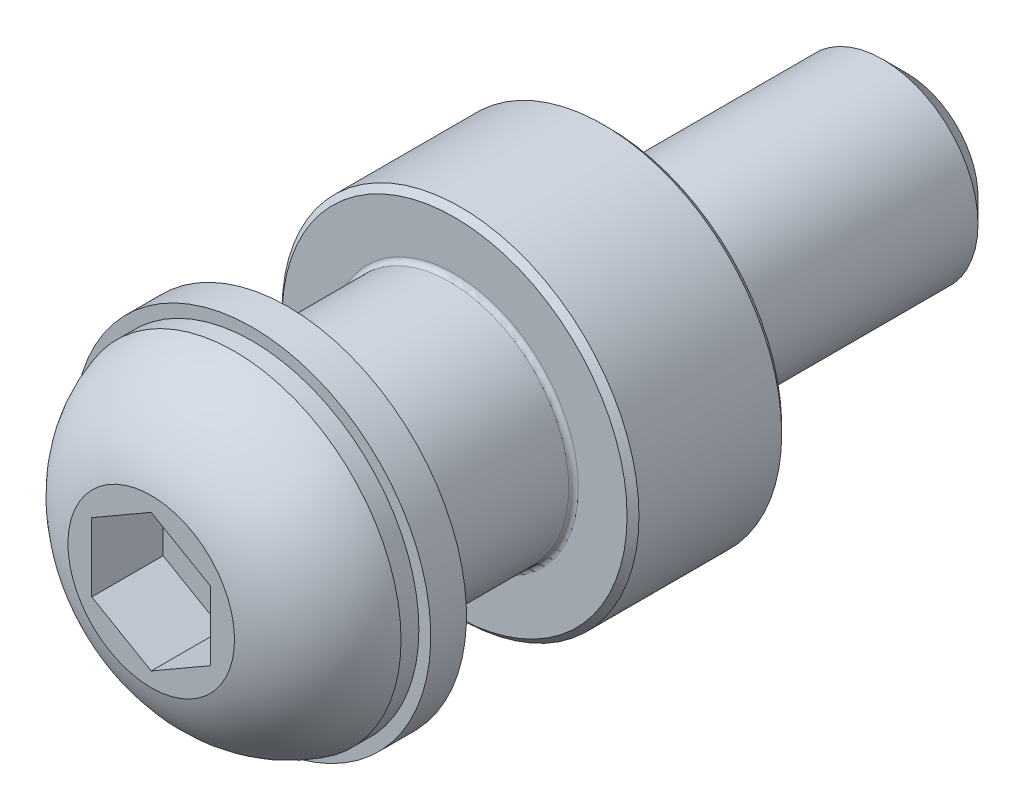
ISO-10303-21;
HEADER;
FILE_DESCRIPTION(('STEP AP214'),'2;1');
FILE_NAME('part.step','',(''),(''),'','','');
FILE_SCHEMA(('AUTOMOTIVE_DESIGN { 1 0 10303 214 1 1 1 1 }'));
ENDSEC;
DATA;
#1=APPLICATION_CONTEXT('core data for automotive mechanical design processes');
#2=APPLICATION_PROTOCOL_DEFINITION('international standard','automotive_design',2000,#1);
#3=PRODUCT_CONTEXT('',#1,'mechanical');
#4=PRODUCT('Part','Part','',(#3));
#5=PRODUCT_RELATED_PRODUCT_CATEGORY('part','',(#4));
#6=PRODUCT_DEFINITION_FORMATION('','',#4);
#7=PRODUCT_DEFINITION_CONTEXT('part definition',#1,'design');
#8=PRODUCT_DEFINITION('design','',#6,#7);
#9=PRODUCT_DEFINITION_SHAPE('','',#8);
#10=(LENGTH_UNIT() NAMED_UNIT(*) SI_UNIT(.MILLI.,.METRE.));
#11=(NAMED_UNIT(*) PLANE_ANGLE_UNIT() SI_UNIT($,.RADIAN.));
#12=(NAMED_UNIT(*) SI_UNIT($,.STERADIAN.) SOLID_ANGLE_UNIT());
#13=UNCERTAINTY_MEASURE_WITH_UNIT(LENGTH_MEASURE(1.E-05),#10,'distance_accuracy_value','');
#14=(GEOMETRIC_REPRESENTATION_CONTEXT(3) GLOBAL_UNCERTAINTY_ASSIGNED_CONTEXT((#13)) GLOBAL_UNIT_ASSIGNED_CONTEXT((#10,
#11,#12)) REPRESENTATION_CONTEXT('',''));
#15=CARTESIAN_POINT('',(0.,0.,0.));
#16=DIRECTION('',(0.,0.,1.));
#17=DIRECTION('',(1.,0.,0.));
#18=AXIS2_PLACEMENT_3D('',#15,#16,#17);
#19=CARTESIAN_POINT('',(-5.,-8.66025403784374,32.5));
#20=DIRECTION('',(0.,0.,1.));
#21=DIRECTION('',(0.,-1.,0.));
#22=AXIS2_PLACEMENT_3D('',#19,#20,#21);
#23=PLANE('',#22);
#24=DIRECTION('',(-0.86602540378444,-0.5,0.));
#25=VECTOR('',#24,1.);
#26=CARTESIAN_POINT('',(5.,-2.88675134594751,32.5));
#27=LINE('',#26,#25);
#28=CARTESIAN_POINT('',(5.,-2.88675134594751,32.5));
#29=VERTEX_POINT('',#28);
#30=CARTESIAN_POINT('',(0.,-5.77350269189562,32.5));
#31=VERTEX_POINT('',#30);
#32=EDGE_CURVE('E68',#29,#31,#27,.T.);
#33=ORIENTED_EDGE('',*,*,#32,.F.);
#34=DIRECTION('',(0.,-1.,0.));
#35=VECTOR('',#34,1.);
#36=CARTESIAN_POINT('',(5.,2.88675134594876,32.5));
#37=LINE('',#36,#35);
#38=CARTESIAN_POINT('',(5.,2.88675134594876,32.5));
#39=VERTEX_POINT('',#38);
#40=EDGE_CURVE('E116',#39,#29,#37,.T.);
#41=ORIENTED_EDGE('',*,*,#40,.F.);
#42=DIRECTION('',(-0.86602540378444,0.5,0.));
#43=VECTOR('',#42,1.);
#44=CARTESIAN_POINT('',(5.,2.88675134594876,32.5));
#45=LINE('',#44,#43);
#46=CARTESIAN_POINT('',(0.,5.77350269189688,32.5));
#47=VERTEX_POINT('',#46);
#48=EDGE_CURVE('E113',#39,#47,#45,.T.);
#49=ORIENTED_EDGE('',*,*,#48,.T.);
#50=DIRECTION('',(0.86602540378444,0.5,0.));
#51=VECTOR('',#50,1.);
#52=CARTESIAN_POINT('',(-5.,2.88675134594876,32.5));
#53=LINE('',#52,#51);
#54=CARTESIAN_POINT('',(-5.,2.88675134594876,32.5));
#55=VERTEX_POINT('',#54);
#56=EDGE_CURVE('E110',#55,#47,#53,.T.);
#57=ORIENTED_EDGE('',*,*,#56,.F.);
#58=DIRECTION('',(0.,-1.,0.));
#59=VECTOR('',#58,1.);
#60=CARTESIAN_POINT('',(-5.,2.88675134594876,32.5));
#61=LINE('',#60,#59);
#62=CARTESIAN_POINT('',(-5.,-2.88675134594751,32.5));
#63=VERTEX_POINT('',#62);
#64=EDGE_CURVE('E107',#55,#63,#61,.T.);
#65=ORIENTED_EDGE('',*,*,#64,.T.);
#66=DIRECTION('',(0.86602540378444,-0.5,0.));
#67=VECTOR('',#66,1.);
#68=CARTESIAN_POINT('',(-5.,-2.88675134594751,32.5));
#69=LINE('',#68,#67);
#70=EDGE_CURVE('E105',#63,#31,#69,.T.);
#71=ORIENTED_EDGE('',*,*,#70,.T.);
#72=EDGE_LOOP('',(#33,#41,#49,#57,#65,#71));
#73=FACE_BOUND('',#72,.T.);
#74=ADVANCED_FACE('F14',(#73),#23,.T.);
#75=CARTESIAN_POINT('',(5.,2.88675134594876,32.5));
#76=DIRECTION('',(0.5,0.86602540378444,0.));
#77=DIRECTION('',(-0.86602540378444,0.5,0.));
#78=AXIS2_PLACEMENT_3D('',#75,#76,#77);
#79=PLANE('',#78);
#80=DIRECTION('',(0.,0.,1.));
#81=VECTOR('',#80,1.);
#82=CARTESIAN_POINT('',(5.,2.88675134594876,32.5));
#83=LINE('',#82,#81);
#84=CARTESIAN_POINT('',(5.,2.88675134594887,38.5));
#85=VERTEX_POINT('',#84);
#86=EDGE_CURVE('E120',#39,#85,#83,.T.);
#87=ORIENTED_EDGE('',*,*,#86,.T.);
#88=DIRECTION('',(-0.86602540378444,0.5,0.));
#89=VECTOR('',#88,1.);
#90=CARTESIAN_POINT('',(5.,2.88675134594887,38.5));
#91=LINE('',#90,#89);
#92=CARTESIAN_POINT('',(0.,5.77350269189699,38.5));
#93=VERTEX_POINT('',#92);
#94=EDGE_CURVE('E100',#85,#93,#91,.T.);
#95=ORIENTED_EDGE('',*,*,#94,.T.);
#96=DIRECTION('',(0.,0.,1.));
#97=VECTOR('',#96,1.);
#98=CARTESIAN_POINT('',(0.,5.77350269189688,32.5));
#99=LINE('',#98,#97);
#100=EDGE_CURVE('E122',#47,#93,#99,.T.);
#101=ORIENTED_EDGE('',*,*,#100,.F.);
#102=ORIENTED_EDGE('',*,*,#48,.F.);
#103=EDGE_LOOP('',(#87,#95,#101,#102));
#104=FACE_BOUND('',#103,.T.);
#105=ADVANCED_FACE('F197',(#104),#79,.F.);
#106=CARTESIAN_POINT('',(-5.,2.88675134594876,32.5));
#107=DIRECTION('',(0.5,-0.86602540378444,0.));
#108=DIRECTION('',(0.86602540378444,0.5,0.));
#109=AXIS2_PLACEMENT_3D('',#106,#107,#108);
#110=PLANE('',#109);
#111=ORIENTED_EDGE('',*,*,#100,.T.);
#112=DIRECTION('',(0.86602540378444,0.5,0.));
#113=VECTOR('',#112,1.);
#114=CARTESIAN_POINT('',(-5.,2.88675134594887,38.5));
#115=LINE('',#114,#113);
#116=CARTESIAN_POINT('',(-5.,2.88675134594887,38.5));
#117=VERTEX_POINT('',#116);
#118=EDGE_CURVE('E97',#117,#93,#115,.T.);
#119=ORIENTED_EDGE('',*,*,#118,.F.);
#120=DIRECTION('',(0.,0.,1.));
#121=VECTOR('',#120,1.);
#122=CARTESIAN_POINT('',(-5.,2.88675134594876,32.5));
#123=LINE('',#122,#121);
#124=EDGE_CURVE('E124',#55,#117,#123,.T.);
#125=ORIENTED_EDGE('',*,*,#124,.F.);
#126=ORIENTED_EDGE('',*,*,#56,.T.);
#127=EDGE_LOOP('',(#111,#119,#125,#126));
#128=FACE_BOUND('',#127,.T.);
#129=ADVANCED_FACE('F204',(#128),#110,.T.);
#130=CARTESIAN_POINT('',(-5.,2.88675134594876,32.5));
#131=DIRECTION('',(-1.,0.,0.));
#132=DIRECTION('',(0.,-1.,0.));
#133=AXIS2_PLACEMENT_3D('',#130,#131,#132);
#134=PLANE('',#133);
#135=ORIENTED_EDGE('',*,*,#124,.T.);
#136=DIRECTION('',(0.,-1.,0.));
#137=VECTOR('',#136,1.);
#138=CARTESIAN_POINT('',(-5.,2.88675134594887,38.5));
#139=LINE('',#138,#137);
#140=CARTESIAN_POINT('',(-5.,-2.8867513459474,38.5));
#141=VERTEX_POINT('',#140);
#142=EDGE_CURVE('E81',#117,#141,#139,.T.);
#143=ORIENTED_EDGE('',*,*,#142,.T.);
#144=DIRECTION('',(0.,0.,1.));
#145=VECTOR('',#144,1.);
#146=CARTESIAN_POINT('',(-5.,-2.88675134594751,32.5));
#147=LINE('',#146,#145);
#148=EDGE_CURVE('E73',#63,#141,#147,.T.);
#149=ORIENTED_EDGE('',*,*,#148,.F.);
#150=ORIENTED_EDGE('',*,*,#64,.F.);
#151=EDGE_LOOP('',(#135,#143,#149,#150));
#152=FACE_BOUND('',#151,.T.);
#153=ADVANCED_FACE('F219',(#152),#134,.F.);
#154=CARTESIAN_POINT('',(-5.,-2.88675134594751,32.5));
#155=DIRECTION('',(-0.5,-0.86602540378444,0.));
#156=DIRECTION('',(0.86602540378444,-0.5,0.));
#157=AXIS2_PLACEMENT_3D('',#154,#155,#156);
#158=PLANE('',#157);
#159=ORIENTED_EDGE('',*,*,#148,.T.);
#160=DIRECTION('',(0.86602540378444,-0.5,0.));
#161=VECTOR('',#160,1.);
#162=CARTESIAN_POINT('',(-5.,-2.8867513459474,38.5));
#163=LINE('',#162,#161);
#164=CARTESIAN_POINT('',(0.,-5.77350269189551,38.5));
#165=VERTEX_POINT('',#164);
#166=EDGE_CURVE('E76',#141,#165,#163,.T.);
#167=ORIENTED_EDGE('',*,*,#166,.T.);
#168=DIRECTION('',(0.,0.,1.));
#169=VECTOR('',#168,1.);
#170=CARTESIAN_POINT('',(0.,-5.77350269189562,32.5));
#171=LINE('',#170,#169);
#172=EDGE_CURVE('E65',#31,#165,#171,.T.);
#173=ORIENTED_EDGE('',*,*,#172,.F.);
#174=ORIENTED_EDGE('',*,*,#70,.F.);
#175=EDGE_LOOP('',(#159,#167,#173,#174));
#176=FACE_BOUND('',#175,.T.);
#177=ADVANCED_FACE('F77',(#176),#158,.F.);
#178=CARTESIAN_POINT('',(5.,-2.88675134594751,32.5));
#179=DIRECTION('',(-0.5,0.86602540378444,0.));
#180=DIRECTION('',(-0.86602540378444,-0.5,0.));
#181=AXIS2_PLACEMENT_3D('',#178,#179,#180);
#182=PLANE('',#181);
#183=ORIENTED_EDGE('',*,*,#172,.T.);
#184=DIRECTION('',(-0.86602540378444,-0.5,0.));
#185=VECTOR('',#184,1.);
#186=CARTESIAN_POINT('',(5.,-2.8867513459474,38.5));
#187=LINE('',#186,#185);
#188=CARTESIAN_POINT('',(5.,-2.88675134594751,38.5));
#189=VERTEX_POINT('',#188);
#190=EDGE_CURVE('E31',#189,#165,#187,.T.);
#191=ORIENTED_EDGE('',*,*,#190,.F.);
#192=DIRECTION('',(0.,0.,1.));
#193=VECTOR('',#192,1.);
#194=CARTESIAN_POINT('',(5.,-2.88675134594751,32.5));
#195=LINE('',#194,#193);
#196=EDGE_CURVE('E35',#29,#189,#195,.T.);
#197=ORIENTED_EDGE('',*,*,#196,.F.);
#198=ORIENTED_EDGE('',*,*,#32,.T.);
#199=EDGE_LOOP('',(#183,#191,#197,#198));
#200=FACE_BOUND('',#199,.T.);
#201=ADVANCED_FACE('F67',(#200),#182,.T.);
#202=CARTESIAN_POINT('',(5.,2.88675134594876,32.5));
#203=DIRECTION('',(-1.,0.,0.));
#204=DIRECTION('',(0.,-1.,0.));
#205=AXIS2_PLACEMENT_3D('',#202,#203,#204);
#206=PLANE('',#205);
#207=ORIENTED_EDGE('',*,*,#40,.T.);
#208=ORIENTED_EDGE('',*,*,#196,.T.);
#209=DIRECTION('',(0.,-1.,0.));
#210=VECTOR('',#209,1.);
#211=CARTESIAN_POINT('',(5.,2.88675134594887,38.5));
#212=LINE('',#211,#210);
#213=EDGE_CURVE('E87',#85,#189,#212,.T.);
#214=ORIENTED_EDGE('',*,*,#213,.F.);
#215=ORIENTED_EDGE('',*,*,#86,.F.);
#216=EDGE_LOOP('',(#207,#208,#214,#215));
#217=FACE_BOUND('',#216,.T.);
#218=ADVANCED_FACE('F213',(#217),#206,.T.);
#219=CARTESIAN_POINT('',(0.,0.,38.5));
#220=DIRECTION('',(0.,0.,1.));
#221=DIRECTION('',(0.,-1.,0.));
#222=AXIS2_PLACEMENT_3D('',#219,#220,#221);
#223=PLANE('',#222);
#224=CARTESIAN_POINT('',(0.,9.24247413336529E-13,38.5));
#225=DIRECTION('',(0.,0.,1.));
#226=DIRECTION('',(0.,-1.,0.));
#227=AXIS2_PLACEMENT_3D('',#224,#225,#226);
#228=CIRCLE('',#227,6.99999999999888);
#229=CARTESIAN_POINT('',(0.,-6.99999999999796,38.5000000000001));
#230=VERTEX_POINT('',#229);
#231=EDGE_CURVE('E72',#230,#230,#228,.T.);
#232=ORIENTED_EDGE('',*,*,#231,.T.);
#233=EDGE_LOOP('',(#232));
#234=FACE_BOUND('',#233,.T.);
#235=ORIENTED_EDGE('',*,*,#213,.T.);
#236=ORIENTED_EDGE('',*,*,#190,.T.);
#237=ORIENTED_EDGE('',*,*,#166,.F.);
#238=ORIENTED_EDGE('',*,*,#142,.F.);
#239=ORIENTED_EDGE('',*,*,#118,.T.);
#240=ORIENTED_EDGE('',*,*,#94,.F.);
#241=EDGE_LOOP('',(#235,#236,#237,#238,#239,#240));
#242=FACE_BOUND('',#241,.T.);
#243=ADVANCED_FACE('F84',(#234,#242),#223,.T.);
#244=CARTESIAN_POINT('',(0.,7.43811968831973E-13,28.8558971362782));
#245=DIRECTION('',(0.,0.,1.));
#246=DIRECTION('',(0.,-1.,0.));
#247=AXIS2_PLACEMENT_3D('',#244,#245,#246);
#248=DEGENERATE_TOROIDAL_SURFACE('',#247,4.35589713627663,10.,.T.);
#249=ORIENTED_EDGE('',*,*,#231,.F.);
#250=EDGE_LOOP('',(#249));
#251=FACE_BOUND('',#250,.T.);
#252=CARTESIAN_POINT('',(0.,7.93549495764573E-13,31.5));
#253=DIRECTION('',(0.,0.,1.));
#254=DIRECTION('',(0.,-1.,0.));
#255=AXIS2_PLACEMENT_3D('',#252,#253,#254);
#256=CIRCLE('',#255,13.9999999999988);
#257=CARTESIAN_POINT('',(0.,-13.999999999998,31.5000000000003));
#258=VERTEX_POINT('',#257);
#259=EDGE_CURVE('E129',#258,#258,#256,.T.);
#260=ORIENTED_EDGE('',*,*,#259,.T.);
#261=EDGE_LOOP('',(#260));
#262=FACE_BOUND('',#261,.T.);
#263=ADVANCED_FACE('F180',(#251,#262),#248,.T.);
#264=CARTESIAN_POINT('',(0.,1.14224325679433E-12,50.17555637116));
#265=DIRECTION('',(0.,0.,1.));
#266=DIRECTION('',(0.,-1.,0.));
#267=AXIS2_PLACEMENT_3D('',#264,#265,#266);
#268=CYLINDRICAL_SURFACE('',#267,13.9999999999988);
#269=ORIENTED_EDGE('',*,*,#259,.F.);
#270=EDGE_LOOP('',(#269));
#271=FACE_BOUND('',#270,.T.);
#272=CARTESIAN_POINT('',(0.,7.65542799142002E-13,30.));
#273=DIRECTION('',(0.,0.,-1.));
#274=DIRECTION('',(0.,1.,0.));
#275=AXIS2_PLACEMENT_3D('',#272,#273,#274);
#276=CIRCLE('',#275,13.9999999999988);
#277=CARTESIAN_POINT('',(0.,13.9999999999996,29.9999999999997));
#278=VERTEX_POINT('',#277);
#279=EDGE_CURVE('E91',#278,#278,#276,.T.);
#280=ORIENTED_EDGE('',*,*,#279,.F.);
#281=EDGE_LOOP('',(#280));
#282=FACE_BOUND('',#281,.T.);
#283=ADVANCED_FACE('F178',(#271,#282),#268,.T.);
#284=CARTESIAN_POINT('',(0.,7.65542799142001E-13,30.));
#285=DIRECTION('',(0.,0.,-1.));
#286=DIRECTION('',(0.,1.,0.));
#287=AXIS2_PLACEMENT_3D('',#284,#285,#286);
#288=PLANE('',#287);
#289=CARTESIAN_POINT('',(0.,7.65542799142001E-13,30.));
#290=DIRECTION('',(0.,0.,-1.));
#291=DIRECTION('',(0.,1.,0.));
#292=AXIS2_PLACEMENT_3D('',#289,#290,#291);
#293=CIRCLE('',#292,15.);
#294=CARTESIAN_POINT('',(0.,15.0000000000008,29.9999999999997));
#295=VERTEX_POINT('',#294);
#296=EDGE_CURVE('E162',#295,#295,#293,.T.);
#297=ORIENTED_EDGE('',*,*,#296,.F.);
#298=EDGE_LOOP('',(#297));
#299=FACE_BOUND('',#298,.T.);
#300=ORIENTED_EDGE('',*,*,#279,.T.);
#301=EDGE_LOOP('',(#300));
#302=FACE_BOUND('',#301,.T.);
#303=ADVANCED_FACE('F176',(#299,#302),#288,.F.);
#304=CARTESIAN_POINT('',(0.,7.09529405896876E-13,27.));
#305=DIRECTION('',(0.,0.,1.));
#306=DIRECTION('',(0.,-1.,0.));
#307=AXIS2_PLACEMENT_3D('',#304,#305,#306);
#308=CYLINDRICAL_SURFACE('',#307,15.);
#309=CARTESIAN_POINT('',(0.,7.09529405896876E-13,27.));
#310=DIRECTION('',(0.,0.,-1.));
#311=DIRECTION('',(0.,1.,0.));
#312=AXIS2_PLACEMENT_3D('',#309,#310,#311);
#313=CIRCLE('',#312,15.);
#314=CARTESIAN_POINT('',(0.,15.0000000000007,26.9999999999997));
#315=VERTEX_POINT('',#314);
#316=EDGE_CURVE('E166',#315,#315,#313,.T.);
#317=ORIENTED_EDGE('',*,*,#316,.F.);
#318=EDGE_LOOP('',(#317));
#319=FACE_BOUND('',#318,.T.);
#320=ORIENTED_EDGE('',*,*,#296,.T.);
#321=EDGE_LOOP('',(#320));
#322=FACE_BOUND('',#321,.T.);
#323=ADVANCED_FACE('F189',(#319,#322),#308,.T.);
#324=CARTESIAN_POINT('',(0.,7.09529405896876E-13,27.));
#325=DIRECTION('',(0.,0.,-1.));
#326=DIRECTION('',(0.,1.,0.));
#327=AXIS2_PLACEMENT_3D('',#324,#325,#326);
#328=PLANE('',#327);
#329=ORIENTED_EDGE('',*,*,#316,.T.);
#330=EDGE_LOOP('',(#329));
#331=FACE_BOUND('',#330,.T.);
#332=CARTESIAN_POINT('',(0.,7.09529405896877E-13,27.));
#333=DIRECTION('',(0.,0.,-1.));
#334=DIRECTION('',(0.,1.,0.));
#335=AXIS2_PLACEMENT_3D('',#332,#333,#334);
#336=CIRCLE('',#335,7.99999999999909);
#337=CARTESIAN_POINT('',(0.,7.9999999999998,26.9999999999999));
#338=VERTEX_POINT('',#337);
#339=EDGE_CURVE('E88',#338,#338,#336,.T.);
#340=ORIENTED_EDGE('',*,*,#339,.F.);
#341=EDGE_LOOP('',(#340));
#342=FACE_BOUND('',#341,.T.);
#343=ADVANCED_FACE('F303',(#331,#342),#328,.T.);
#344=CARTESIAN_POINT('',(0.,1.14224325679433E-12,50.17555637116));
#345=DIRECTION('',(0.,0.,1.));
#346=DIRECTION('',(0.,-1.,0.));
#347=AXIS2_PLACEMENT_3D('',#344,#345,#346);
#348=CYLINDRICAL_SURFACE('',#347,7.99999999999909);
#349=CARTESIAN_POINT('',(0.,7.00193840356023E-13,26.5));
#350=DIRECTION('',(0.,0.,1.));
#351=DIRECTION('',(1.,0.,0.));
#352=AXIS2_PLACEMENT_3D('',#349,#350,#351);
#353=CIRCLE('',#352,7.99999999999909);
#354=CARTESIAN_POINT('',(7.99999999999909,7.00193840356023E-13,26.5));
#355=VERTEX_POINT('',#354);
#356=EDGE_CURVE('E23',#355,#355,#353,.T.);
#357=ORIENTED_EDGE('',*,*,#356,.T.);
#358=EDGE_LOOP('',(#357));
#359=FACE_BOUND('',#358,.T.);
#360=ORIENTED_EDGE('',*,*,#339,.T.);
#361=EDGE_LOOP('',(#360));
#362=FACE_BOUND('',#361,.T.);
#363=ADVANCED_FACE('F310',(#359,#362),#348,.T.);
#364=CARTESIAN_POINT('',(0.,2.05408866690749E-13,0.));
#365=DIRECTION('',(0.,0.,-1.));
#366=DIRECTION('',(-1.,0.,0.));
#367=AXIS2_PLACEMENT_3D('',#364,#365,#366);
#368=CIRCLE('',#367,7.99999999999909);
#369=CARTESIAN_POINT('',(-7.99999999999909,2.05408866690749E-13,0.));
#370=VERTEX_POINT('',#369);
#371=EDGE_CURVE('E9',#370,#370,#368,.T.);
#372=ORIENTED_EDGE('',*,*,#371,.T.);
#373=EDGE_LOOP('',(#372));
#374=FACE_BOUND('',#373,.T.);
#375=CARTESIAN_POINT('',(0.,-2.2402714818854E-13,-23.));
#376=DIRECTION('',(0.,0.,-1.));
#377=DIRECTION('',(0.,1.,0.));
#378=AXIS2_PLACEMENT_3D('',#375,#376,#377);
#379=CIRCLE('',#378,7.99999999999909);
#380=CARTESIAN_POINT('',(0.,7.99999999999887,-23.0000000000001));
#381=VERTEX_POINT('',#380);
#382=EDGE_CURVE('E135',#381,#381,#379,.F.);
#383=ORIENTED_EDGE('',*,*,#382,.T.);
#384=EDGE_LOOP('',(#383));
#385=FACE_BOUND('',#384,.T.);
#386=ADVANCED_FACE('F318',(#374,#385),#348,.T.);
#387=CARTESIAN_POINT('',(0.,-2.61369410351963E-13,-25.));
#388=DIRECTION('',(0.,0.,-1.));
#389=DIRECTION('',(0.,1.,0.));
#390=AXIS2_PLACEMENT_3D('',#387,#388,#389);
#391=PLANE('',#390);
#392=CARTESIAN_POINT('',(0.,-2.61369410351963E-13,-25.));
#393=DIRECTION('',(0.,0.,-1.));
#394=DIRECTION('',(0.,1.,0.));
#395=AXIS2_PLACEMENT_3D('',#392,#393,#394);
#396=CIRCLE('',#395,5.99999999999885);
#397=CARTESIAN_POINT('',(0.,5.99999999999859,-25.0000000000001));
#398=VERTEX_POINT('',#397);
#399=EDGE_CURVE('E132',#398,#398,#396,.T.);
#400=ORIENTED_EDGE('',*,*,#399,.T.);
#401=EDGE_LOOP('',(#400));
#402=FACE_BOUND('',#401,.T.);
#403=ADVANCED_FACE('F209',(#402),#391,.T.);
#404=CARTESIAN_POINT('',(0.,-2.61369410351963E-13,-25.));
#405=DIRECTION('',(0.,0.,1.));
#406=DIRECTION('',(0.,-1.,0.));
#407=AXIS2_PLACEMENT_3D('',#404,#405,#406);
#408=CONICAL_SURFACE('',#407,5.99999999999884,0.785398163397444);
#409=ORIENTED_EDGE('',*,*,#382,.F.);
#410=EDGE_LOOP('',(#409));
#411=FACE_BOUND('',#410,.T.);
#412=ORIENTED_EDGE('',*,*,#399,.F.);
#413=EDGE_LOOP('',(#412));
#414=FACE_BOUND('',#413,.T.);
#415=ADVANCED_FACE('F334',(#411,#414),#408,.T.);
#416=CARTESIAN_POINT('',(0.,10.,13.));
#417=DIRECTION('',(0.,0.,1.));
#418=DIRECTION('',(1.,0.,0.));
#419=AXIS2_PLACEMENT_3D('',#416,#417,#418);
#420=PLANE('',#419);
#421=CARTESIAN_POINT('',(0.,0.,13.));
#422=DIRECTION('',(0.,0.,1.));
#423=DIRECTION('',(1.,0.,0.));
#424=AXIS2_PLACEMENT_3D('',#421,#422,#423);
#425=CIRCLE('',#424,14.5);
#426=CARTESIAN_POINT('',(14.5,0.,13.));
#427=VERTEX_POINT('',#426);
#428=EDGE_CURVE('E155',#427,#427,#425,.T.);
#429=ORIENTED_EDGE('',*,*,#428,.T.);
#430=EDGE_LOOP('',(#429));
#431=FACE_BOUND('',#430,.T.);
#432=CARTESIAN_POINT('',(0.,0.,13.));
#433=DIRECTION('',(0.,0.,1.));
#434=DIRECTION('',(1.,0.,0.));
#435=AXIS2_PLACEMENT_3D('',#432,#433,#434);
#436=CIRCLE('',#435,10.4);
#437=CARTESIAN_POINT('',(10.4,0.,13.));
#438=VERTEX_POINT('',#437);
#439=EDGE_CURVE('E140',#438,#438,#436,.F.);
#440=ORIENTED_EDGE('',*,*,#439,.T.);
#441=EDGE_LOOP('',(#440));
#442=FACE_BOUND('',#441,.T.);
#443=ADVANCED_FACE('F342',(#431,#442),#420,.T.);
#444=CARTESIAN_POINT('',(0.,0.,13.4));
#445=DIRECTION('',(0.,0.,1.));
#446=DIRECTION('',(1.,0.,0.));
#447=AXIS2_PLACEMENT_3D('',#444,#445,#446);
#448=TOROIDAL_SURFACE('',#447,10.4,0.4);
#449=CARTESIAN_POINT('',(0.,0.,13.4));
#450=DIRECTION('',(0.,0.,1.));
#451=DIRECTION('',(1.,0.,0.));
#452=AXIS2_PLACEMENT_3D('',#449,#450,#451);
#453=CIRCLE('',#452,10.);
#454=CARTESIAN_POINT('',(10.,0.,13.4));
#455=VERTEX_POINT('',#454);
#456=EDGE_CURVE('E143',#455,#455,#453,.T.);
#457=ORIENTED_EDGE('',*,*,#456,.F.);
#458=EDGE_LOOP('',(#457));
#459=FACE_BOUND('',#458,.T.);
#460=ORIENTED_EDGE('',*,*,#439,.F.);
#461=EDGE_LOOP('',(#460));
#462=FACE_BOUND('',#461,.T.);
#463=ADVANCED_FACE('F351',(#459,#462),#448,.F.);
#464=CARTESIAN_POINT('',(0.,0.,0.));
#465=DIRECTION('',(0.,0.,-1.));
#466=DIRECTION('',(-1.,0.,0.));
#467=AXIS2_PLACEMENT_3D('',#464,#465,#466);
#468=CYLINDRICAL_SURFACE('',#467,10.);
#469=CARTESIAN_POINT('',(0.,0.,26.));
#470=DIRECTION('',(0.,0.,1.));
#471=DIRECTION('',(1.,0.,0.));
#472=AXIS2_PLACEMENT_3D('',#469,#470,#471);
#473=CIRCLE('',#472,10.);
#474=CARTESIAN_POINT('',(10.,0.,26.));
#475=VERTEX_POINT('',#474);
#476=EDGE_CURVE('E157',#475,#475,#473,.F.);
#477=ORIENTED_EDGE('',*,*,#476,.T.);
#478=EDGE_LOOP('',(#477));
#479=FACE_BOUND('',#478,.T.);
#480=ORIENTED_EDGE('',*,*,#456,.T.);
#481=EDGE_LOOP('',(#480));
#482=FACE_BOUND('',#481,.T.);
#483=ADVANCED_FACE('F355',(#479,#482),#468,.T.);
#484=CARTESIAN_POINT('',(0.,0.,26.));
#485=DIRECTION('',(0.,0.,-1.));
#486=DIRECTION('',(-1.,0.,0.));
#487=AXIS2_PLACEMENT_3D('',#484,#485,#486);
#488=CONICAL_SURFACE('',#487,10.,0.78539816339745);
#489=CARTESIAN_POINT('',(0.,0.,26.5));
#490=DIRECTION('',(0.,0.,1.));
#491=DIRECTION('',(1.,0.,0.));
#492=AXIS2_PLACEMENT_3D('',#489,#490,#491);
#493=CIRCLE('',#492,9.5);
#494=CARTESIAN_POINT('',(9.5,0.,26.5));
#495=VERTEX_POINT('',#494);
#496=EDGE_CURVE('E18',#495,#495,#493,.T.);
#497=ORIENTED_EDGE('',*,*,#496,.F.);
#498=EDGE_LOOP('',(#497));
#499=FACE_BOUND('',#498,.T.);
#500=ORIENTED_EDGE('',*,*,#476,.F.);
#501=EDGE_LOOP('',(#500));
#502=FACE_BOUND('',#501,.T.);
#503=ADVANCED_FACE('F16',(#499,#502),#488,.T.);
#504=CARTESIAN_POINT('',(0.,8.2,26.5));
#505=DIRECTION('',(0.,0.,1.));
#506=DIRECTION('',(1.,0.,0.));
#507=AXIS2_PLACEMENT_3D('',#504,#505,#506);
#508=PLANE('',#507);
#509=ORIENTED_EDGE('',*,*,#496,.T.);
#510=EDGE_LOOP('',(#509));
#511=FACE_BOUND('',#510,.T.);
#512=ORIENTED_EDGE('',*,*,#356,.F.);
#513=EDGE_LOOP('',(#512));
#514=FACE_BOUND('',#513,.T.);
#515=ADVANCED_FACE('F372',(#511,#514),#508,.T.);
#516=CARTESIAN_POINT('',(0.,0.,12.5));
#517=DIRECTION('',(0.,0.,-1.));
#518=DIRECTION('',(-1.,0.,0.));
#519=AXIS2_PLACEMENT_3D('',#516,#517,#518);
#520=CONICAL_SURFACE('',#519,15.,0.78539816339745);
#521=ORIENTED_EDGE('',*,*,#428,.F.);
#522=EDGE_LOOP('',(#521));
#523=FACE_BOUND('',#522,.T.);
#524=CARTESIAN_POINT('',(0.,0.,12.5));
#525=DIRECTION('',(0.,0.,1.));
#526=DIRECTION('',(1.,0.,0.));
#527=AXIS2_PLACEMENT_3D('',#524,#525,#526);
#528=CIRCLE('',#527,15.);
#529=CARTESIAN_POINT('',(15.,0.,12.5));
#530=VERTEX_POINT('',#529);
#531=EDGE_CURVE('E149',#530,#530,#528,.F.);
#532=ORIENTED_EDGE('',*,*,#531,.F.);
#533=EDGE_LOOP('',(#532));
#534=FACE_BOUND('',#533,.T.);
#535=ADVANCED_FACE('F380',(#523,#534),#520,.T.);
#536=CARTESIAN_POINT('',(0.,0.,0.));
#537=DIRECTION('',(0.,0.,-1.));
#538=DIRECTION('',(-1.,0.,0.));
#539=AXIS2_PLACEMENT_3D('',#536,#537,#538);
#540=CYLINDRICAL_SURFACE('',#539,15.);
#541=CARTESIAN_POINT('',(0.,0.,0.5));
#542=DIRECTION('',(0.,0.,-1.));
#543=DIRECTION('',(-1.,0.,0.));
#544=AXIS2_PLACEMENT_3D('',#541,#542,#543);
#545=CIRCLE('',#544,15.);
#546=CARTESIAN_POINT('',(-15.,0.,0.5));
#547=VERTEX_POINT('',#546);
#548=EDGE_CURVE('E152',#547,#547,#545,.F.);
#549=ORIENTED_EDGE('',*,*,#548,.T.);
#550=EDGE_LOOP('',(#549));
#551=FACE_BOUND('',#550,.T.);
#552=ORIENTED_EDGE('',*,*,#531,.T.);
#553=EDGE_LOOP('',(#552));
#554=FACE_BOUND('',#553,.T.);
#555=ADVANCED_FACE('F354',(#551,#554),#540,.T.);
#556=CARTESIAN_POINT('',(0.,0.,0.));
#557=DIRECTION('',(0.,0.,1.));
#558=DIRECTION('',(1.,0.,0.));
#559=AXIS2_PLACEMENT_3D('',#556,#557,#558);
#560=CONICAL_SURFACE('',#559,14.5,0.785398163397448);
#561=ORIENTED_EDGE('',*,*,#548,.F.);
#562=EDGE_LOOP('',(#561));
#563=FACE_BOUND('',#562,.T.);
#564=CARTESIAN_POINT('',(0.,0.,0.));
#565=DIRECTION('',(0.,0.,-1.));
#566=DIRECTION('',(-1.,0.,0.));
#567=AXIS2_PLACEMENT_3D('',#564,#565,#566);
#568=CIRCLE('',#567,14.5);
#569=CARTESIAN_POINT('',(-14.5,0.,0.));
#570=VERTEX_POINT('',#569);
#571=EDGE_CURVE('E146',#570,#570,#568,.T.);
#572=ORIENTED_EDGE('',*,*,#571,.F.);
#573=EDGE_LOOP('',(#572));
#574=FACE_BOUND('',#573,.T.);
#575=ADVANCED_FACE('F364',(#563,#574),#560,.T.);
#576=CARTESIAN_POINT('',(0.,15.,0.));
#577=DIRECTION('',(0.,0.,-1.));
#578=DIRECTION('',(-1.,0.,0.));
#579=AXIS2_PLACEMENT_3D('',#576,#577,#578);
#580=PLANE('',#579);
#581=ORIENTED_EDGE('',*,*,#571,.T.);
#582=EDGE_LOOP('',(#581));
#583=FACE_BOUND('',#582,.T.);
#584=ORIENTED_EDGE('',*,*,#371,.F.);
#585=EDGE_LOOP('',(#584));
#586=FACE_BOUND('',#585,.T.);
#587=ADVANCED_FACE('F320',(#583,#586),#580,.T.);
#588=CLOSED_SHELL('',(#74,#105,#129,#153,#177,#201,#218,#243,#263,#283,#303,#323,#343,#363,#386,
#403,#415,#443,#463,#483,#503,#515,#535,#555,#575,#587));
#589=MANIFOLD_SOLID_BREP('B1',#588);
#590=ADVANCED_BREP_SHAPE_REPRESENTATION('',(#18,#589),#14);
#591=SHAPE_DEFINITION_REPRESENTATION(#9,#590);
ENDSEC;
END-ISO-10303-21;
